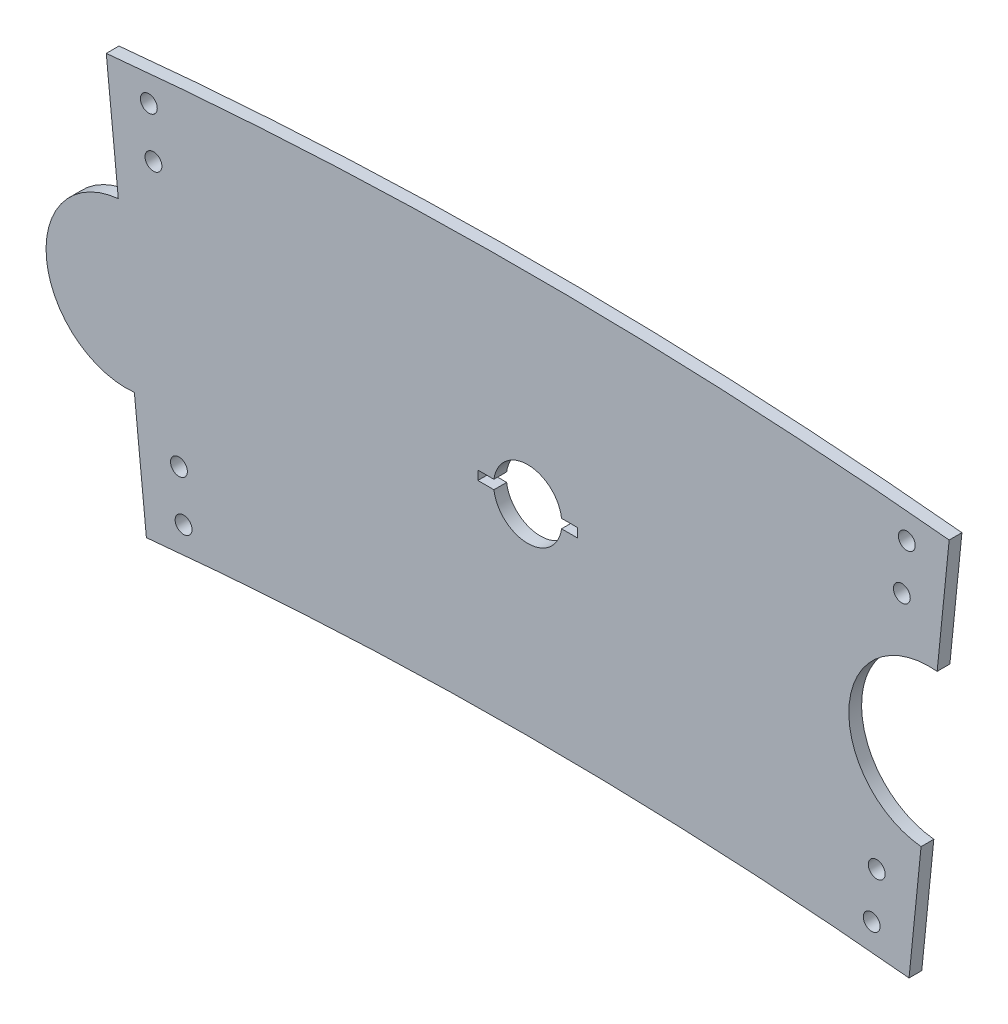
ISO-10303-21;
HEADER;
FILE_DESCRIPTION(('STEP AP214'),'2;1');
FILE_NAME('part.step','',(''),(''),'','','');
FILE_SCHEMA(('AUTOMOTIVE_DESIGN { 1 0 10303 214 1 1 1 1 }'));
ENDSEC;
DATA;
#1=APPLICATION_CONTEXT('core data for automotive mechanical design processes');
#2=APPLICATION_PROTOCOL_DEFINITION('international standard','automotive_design',2000,#1);
#3=PRODUCT_CONTEXT('',#1,'mechanical');
#4=PRODUCT('Part','Part','',(#3));
#5=PRODUCT_RELATED_PRODUCT_CATEGORY('part','',(#4));
#6=PRODUCT_DEFINITION_FORMATION('','',#4);
#7=PRODUCT_DEFINITION_CONTEXT('part definition',#1,'design');
#8=PRODUCT_DEFINITION('design','',#6,#7);
#9=PRODUCT_DEFINITION_SHAPE('','',#8);
#10=(LENGTH_UNIT() NAMED_UNIT(*) SI_UNIT(.MILLI.,.METRE.));
#11=(NAMED_UNIT(*) PLANE_ANGLE_UNIT() SI_UNIT($,.RADIAN.));
#12=(NAMED_UNIT(*) SI_UNIT($,.STERADIAN.) SOLID_ANGLE_UNIT());
#13=UNCERTAINTY_MEASURE_WITH_UNIT(LENGTH_MEASURE(1.E-05),#10,'distance_accuracy_value','');
#14=(GEOMETRIC_REPRESENTATION_CONTEXT(3) GLOBAL_UNCERTAINTY_ASSIGNED_CONTEXT((#13)) GLOBAL_UNIT_ASSIGNED_CONTEXT((#10,
#11,#12)) REPRESENTATION_CONTEXT('',''));
#15=CARTESIAN_POINT('',(0.,0.,0.));
#16=DIRECTION('',(0.,0.,1.));
#17=DIRECTION('',(1.,0.,0.));
#18=AXIS2_PLACEMENT_3D('',#15,#16,#17);
#19=CARTESIAN_POINT('',(1.22464679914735E-13,-1000.,3.175));
#20=DIRECTION('',(0.,0.,1.));
#21=DIRECTION('',(1.,0.,0.));
#22=AXIS2_PLACEMENT_3D('',#19,#20,#21);
#23=PLANE('',#22);
#24=CARTESIAN_POINT('',(-93.2394907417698,27.2898067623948,3.175));
#25=DIRECTION('',(0.,0.,1.));
#26=DIRECTION('',(1.,0.,0.));
#27=AXIS2_PLACEMENT_3D('',#24,#25,#26);
#28=CIRCLE('',#27,2.1);
#29=CARTESIAN_POINT('',(-91.1394907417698,27.2898067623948,3.175));
#30=VERTEX_POINT('',#29);
#31=EDGE_CURVE('E482',#30,#30,#28,.T.);
#32=ORIENTED_EDGE('',*,*,#31,.F.);
#33=EDGE_LOOP('',(#32));
#34=FACE_BOUND('',#33,.T.);
#35=CARTESIAN_POINT('',(-86.8968404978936,-35.3901921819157,3.175));
#36=DIRECTION('',(0.,0.,1.));
#37=DIRECTION('',(1.,0.,0.));
#38=AXIS2_PLACEMENT_3D('',#35,#36,#37);
#39=CIRCLE('',#38,2.1);
#40=CARTESIAN_POINT('',(-84.7968404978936,-35.3901921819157,3.175));
#41=VERTEX_POINT('',#40);
#42=EDGE_CURVE('E484',#41,#41,#39,.T.);
#43=ORIENTED_EDGE('',*,*,#42,.F.);
#44=EDGE_LOOP('',(#43));
#45=FACE_BOUND('',#44,.T.);
#46=CARTESIAN_POINT('',(-85.7394907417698,-47.334251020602,3.175));
#47=DIRECTION('',(0.,0.,1.));
#48=DIRECTION('',(1.,0.,0.));
#49=AXIS2_PLACEMENT_3D('',#46,#47,#48);
#50=CIRCLE('',#49,2.1);
#51=CARTESIAN_POINT('',(-83.6394907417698,-47.334251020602,3.175));
#52=VERTEX_POINT('',#51);
#53=EDGE_CURVE('E438',#52,#52,#50,.T.);
#54=ORIENTED_EDGE('',*,*,#53,.F.);
#55=EDGE_LOOP('',(#54));
#56=FACE_BOUND('',#55,.T.);
#57=CARTESIAN_POINT('',(85.7039755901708,-47.2590481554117,3.175));
#58=DIRECTION('',(0.,0.,1.));
#59=DIRECTION('',(1.,0.,0.));
#60=AXIS2_PLACEMENT_3D('',#57,#58,#59);
#61=CIRCLE('',#60,2.1);
#62=CARTESIAN_POINT('',(87.8039755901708,-47.2590481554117,3.175));
#63=VERTEX_POINT('',#62);
#64=EDGE_CURVE('E472',#63,#63,#61,.T.);
#65=ORIENTED_EDGE('',*,*,#64,.F.);
#66=EDGE_LOOP('',(#65));
#67=FACE_BOUND('',#66,.T.);
#68=CARTESIAN_POINT('',(86.9466105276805,-35.3235607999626,3.175));
#69=DIRECTION('',(0.,0.,1.));
#70=DIRECTION('',(1.,0.,0.));
#71=AXIS2_PLACEMENT_3D('',#68,#69,#70);
#72=CIRCLE('',#71,2.1);
#73=CARTESIAN_POINT('',(89.0466105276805,-35.3235607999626,3.175));
#74=VERTEX_POINT('',#73);
#75=EDGE_CURVE('E470',#74,#74,#72,.T.);
#76=ORIENTED_EDGE('',*,*,#75,.F.);
#77=EDGE_LOOP('',(#76));
#78=FACE_BOUND('',#77,.T.);
#79=CARTESIAN_POINT('',(93.2039755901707,27.3650096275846,3.175));
#80=DIRECTION('',(0.,0.,1.));
#81=DIRECTION('',(1.,0.,0.));
#82=AXIS2_PLACEMENT_3D('',#79,#80,#81);
#83=CIRCLE('',#82,2.1);
#84=CARTESIAN_POINT('',(95.3039755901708,27.3650096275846,3.175));
#85=VERTEX_POINT('',#84);
#86=EDGE_CURVE('E473',#85,#85,#83,.T.);
#87=ORIENTED_EDGE('',*,*,#86,.F.);
#88=EDGE_LOOP('',(#87));
#89=FACE_BOUND('',#88,.T.);
#90=CARTESIAN_POINT('',(94.4466105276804,39.3004969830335,3.175));
#91=DIRECTION('',(0.,0.,1.));
#92=DIRECTION('',(1.,0.,0.));
#93=AXIS2_PLACEMENT_3D('',#90,#91,#92);
#94=CIRCLE('',#93,2.1);
#95=CARTESIAN_POINT('',(96.5466105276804,39.3004969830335,3.175));
#96=VERTEX_POINT('',#95);
#97=EDGE_CURVE('E478',#96,#96,#94,.T.);
#98=ORIENTED_EDGE('',*,*,#97,.F.);
#99=EDGE_LOOP('',(#98));
#100=FACE_BOUND('',#99,.T.);
#101=CARTESIAN_POINT('',(-94.3968404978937,39.2338656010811,3.175));
#102=DIRECTION('',(0.,0.,1.));
#103=DIRECTION('',(1.,0.,0.));
#104=AXIS2_PLACEMENT_3D('',#101,#102,#103);
#105=CIRCLE('',#104,2.1);
#106=CARTESIAN_POINT('',(-92.2968404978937,39.2338656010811,3.175));
#107=VERTEX_POINT('',#106);
#108=EDGE_CURVE('E279',#107,#107,#105,.T.);
#109=ORIENTED_EDGE('',*,*,#108,.F.);
#110=EDGE_LOOP('',(#109));
#111=FACE_BOUND('',#110,.T.);
#112=CARTESIAN_POINT('',(1.22464679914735E-13,-1000.,3.175));
#113=DIRECTION('',(0.,0.,1.));
#114=DIRECTION('',(1.,0.,0.));
#115=AXIS2_PLACEMENT_3D('',#112,#113,#114);
#116=CIRCLE('',#115,1050.);
#117=CARTESIAN_POINT('',(105.,44.7368089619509,3.175));
#118=VERTEX_POINT('',#117);
#119=CARTESIAN_POINT('',(-105.,44.7368089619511,3.175));
#120=VERTEX_POINT('',#119);
#121=EDGE_CURVE('E222',#118,#120,#116,.T.);
#122=ORIENTED_EDGE('',*,*,#121,.T.);
#123=DIRECTION('',(0.0999999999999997,-0.99498743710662,0.));
#124=VECTOR('',#123,1.);
#125=CARTESIAN_POINT('',(-105.,44.7368089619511,3.175));
#126=LINE('',#125,#124);
#127=CARTESIAN_POINT('',(-102.,14.8871858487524,3.175));
#128=VERTEX_POINT('',#127);
#129=EDGE_CURVE('E225',#120,#128,#126,.T.);
#130=ORIENTED_EDGE('',*,*,#129,.T.);
#131=CARTESIAN_POINT('',(-100.,-5.01256289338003,3.175));
#132=DIRECTION('',(0.,0.,1.));
#133=DIRECTION('',(1.,0.,0.));
#134=AXIS2_PLACEMENT_3D('',#131,#132,#133);
#135=CIRCLE('',#134,20.);
#136=CARTESIAN_POINT('',(-98.,-24.9123116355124,3.175));
#137=VERTEX_POINT('',#136);
#138=EDGE_CURVE('E228',#128,#137,#135,.T.);
#139=ORIENTED_EDGE('',*,*,#138,.T.);
#140=DIRECTION('',(0.1,-0.99498743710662,0.));
#141=VECTOR('',#140,1.);
#142=CARTESIAN_POINT('',(-95.,-54.761934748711,3.175));
#143=LINE('',#142,#141);
#144=CARTESIAN_POINT('',(-95.,-54.761934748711,3.175));
#145=VERTEX_POINT('',#144);
#146=EDGE_CURVE('E230',#137,#145,#143,.T.);
#147=ORIENTED_EDGE('',*,*,#146,.T.);
#148=CARTESIAN_POINT('',(1.22464679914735E-13,-1000.,3.175));
#149=DIRECTION('',(0.,0.,-1.));
#150=DIRECTION('',(1.,0.,0.));
#151=AXIS2_PLACEMENT_3D('',#148,#149,#150);
#152=CIRCLE('',#151,950.);
#153=CARTESIAN_POINT('',(95.,-54.761934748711,3.175));
#154=VERTEX_POINT('',#153);
#155=EDGE_CURVE('E232',#145,#154,#152,.T.);
#156=ORIENTED_EDGE('',*,*,#155,.T.);
#157=DIRECTION('',(0.1,0.99498743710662,0.));
#158=VECTOR('',#157,1.);
#159=CARTESIAN_POINT('',(95.,-54.761934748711,3.175));
#160=LINE('',#159,#158);
#161=CARTESIAN_POINT('',(98.,-24.9123116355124,3.175));
#162=VERTEX_POINT('',#161);
#163=EDGE_CURVE('E234',#154,#162,#160,.T.);
#164=ORIENTED_EDGE('',*,*,#163,.T.);
#165=CARTESIAN_POINT('',(100.,-5.01256289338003,3.175));
#166=DIRECTION('',(0.,0.,-1.));
#167=DIRECTION('',(1.,0.,0.));
#168=AXIS2_PLACEMENT_3D('',#165,#166,#167);
#169=CIRCLE('',#168,20.);
#170=CARTESIAN_POINT('',(102.,14.8871858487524,3.175));
#171=VERTEX_POINT('',#170);
#172=EDGE_CURVE('E236',#162,#171,#169,.T.);
#173=ORIENTED_EDGE('',*,*,#172,.T.);
#174=DIRECTION('',(0.0999999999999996,0.99498743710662,0.));
#175=VECTOR('',#174,1.);
#176=CARTESIAN_POINT('',(105.,44.7368089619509,3.175));
#177=LINE('',#176,#175);
#178=EDGE_CURVE('E238',#171,#118,#177,.T.);
#179=ORIENTED_EDGE('',*,*,#178,.T.);
#180=EDGE_LOOP('',(#122,#130,#139,#147,#156,#164,#173,#179));
#181=FACE_BOUND('',#180,.T.);
#182=CARTESIAN_POINT('',(0.,0.,3.175));
#183=DIRECTION('',(0.,0.,1.));
#184=DIRECTION('',(1.,0.,0.));
#185=AXIS2_PLACEMENT_3D('',#182,#183,#184);
#186=CIRCLE('',#185,8.5);
#187=CARTESIAN_POINT('',(8.42522254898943,1.125,3.175));
#188=VERTEX_POINT('',#187);
#189=CARTESIAN_POINT('',(-8.42522254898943,1.125,3.175));
#190=VERTEX_POINT('',#189);
#191=EDGE_CURVE('E164',#188,#190,#186,.T.);
#192=ORIENTED_EDGE('',*,*,#191,.F.);
#193=DIRECTION('',(-1.,0.,0.));
#194=VECTOR('',#193,1.);
#195=CARTESIAN_POINT('',(8.42522254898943,1.125,3.175));
#196=LINE('',#195,#194);
#197=CARTESIAN_POINT('',(12.4252225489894,1.125,3.175));
#198=VERTEX_POINT('',#197);
#199=EDGE_CURVE('E156',#198,#188,#196,.T.);
#200=ORIENTED_EDGE('',*,*,#199,.F.);
#201=DIRECTION('',(0.,1.,0.));
#202=VECTOR('',#201,1.);
#203=CARTESIAN_POINT('',(12.4252225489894,1.125,3.175));
#204=LINE('',#203,#202);
#205=CARTESIAN_POINT('',(12.4252225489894,-1.12499999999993,3.175));
#206=VERTEX_POINT('',#205);
#207=EDGE_CURVE('E190',#206,#198,#204,.T.);
#208=ORIENTED_EDGE('',*,*,#207,.F.);
#209=DIRECTION('',(1.,0.,0.));
#210=VECTOR('',#209,1.);
#211=CARTESIAN_POINT('',(12.4252225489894,-1.125,3.175));
#212=LINE('',#211,#210);
#213=CARTESIAN_POINT('',(8.42522254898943,-1.12500000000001,3.175));
#214=VERTEX_POINT('',#213);
#215=EDGE_CURVE('E188',#214,#206,#212,.T.);
#216=ORIENTED_EDGE('',*,*,#215,.F.);
#217=CARTESIAN_POINT('',(0.,0.,3.175));
#218=DIRECTION('',(0.,0.,1.));
#219=DIRECTION('',(1.,0.,0.));
#220=AXIS2_PLACEMENT_3D('',#217,#218,#219);
#221=CIRCLE('',#220,8.5);
#222=CARTESIAN_POINT('',(-8.42522254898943,-1.125,3.175));
#223=VERTEX_POINT('',#222);
#224=EDGE_CURVE('E186',#223,#214,#221,.T.);
#225=ORIENTED_EDGE('',*,*,#224,.F.);
#226=DIRECTION('',(1.,0.,0.));
#227=VECTOR('',#226,1.);
#228=CARTESIAN_POINT('',(-8.42522254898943,-1.125,3.175));
#229=LINE('',#228,#227);
#230=CARTESIAN_POINT('',(-12.4252225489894,-1.125,3.175));
#231=VERTEX_POINT('',#230);
#232=EDGE_CURVE('E184',#231,#223,#229,.T.);
#233=ORIENTED_EDGE('',*,*,#232,.F.);
#234=DIRECTION('',(0.,-1.,0.));
#235=VECTOR('',#234,1.);
#236=CARTESIAN_POINT('',(-12.4252225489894,-1.125,3.175));
#237=LINE('',#236,#235);
#238=CARTESIAN_POINT('',(-12.4252225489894,1.125,3.175));
#239=VERTEX_POINT('',#238);
#240=EDGE_CURVE('E179',#239,#231,#237,.T.);
#241=ORIENTED_EDGE('',*,*,#240,.F.);
#242=DIRECTION('',(-1.,0.,0.));
#243=VECTOR('',#242,1.);
#244=CARTESIAN_POINT('',(-12.4252225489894,1.125,3.175));
#245=LINE('',#244,#243);
#246=EDGE_CURVE('E177',#190,#239,#245,.T.);
#247=ORIENTED_EDGE('',*,*,#246,.F.);
#248=EDGE_LOOP('',(#192,#200,#208,#216,#225,#233,#241,#247));
#249=FACE_BOUND('',#248,.T.);
#250=ADVANCED_FACE('F41',(#34,#45,#56,#67,#78,#89,#100,#111,#181,#249),#23,.T.);
#251=CARTESIAN_POINT('',(1.22464679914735E-13,-1000.,0.));
#252=DIRECTION('',(0.,0.,1.));
#253=DIRECTION('',(1.,0.,0.));
#254=AXIS2_PLACEMENT_3D('',#251,#252,#253);
#255=PLANE('',#254);
#256=CARTESIAN_POINT('',(-93.2394907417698,27.2898067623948,0.));
#257=DIRECTION('',(0.,0.,1.));
#258=DIRECTION('',(1.,0.,0.));
#259=AXIS2_PLACEMENT_3D('',#256,#257,#258);
#260=CIRCLE('',#259,2.1);
#261=CARTESIAN_POINT('',(-91.1394907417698,27.2898067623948,0.));
#262=VERTEX_POINT('',#261);
#263=EDGE_CURVE('E45',#262,#262,#260,.T.);
#264=ORIENTED_EDGE('',*,*,#263,.T.);
#265=EDGE_LOOP('',(#264));
#266=FACE_BOUND('',#265,.T.);
#267=CARTESIAN_POINT('',(-86.8968404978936,-35.3901921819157,0.));
#268=DIRECTION('',(0.,0.,1.));
#269=DIRECTION('',(1.,0.,0.));
#270=AXIS2_PLACEMENT_3D('',#267,#268,#269);
#271=CIRCLE('',#270,2.1);
#272=CARTESIAN_POINT('',(-84.7968404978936,-35.3901921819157,0.));
#273=VERTEX_POINT('',#272);
#274=EDGE_CURVE('E293',#273,#273,#271,.T.);
#275=ORIENTED_EDGE('',*,*,#274,.T.);
#276=EDGE_LOOP('',(#275));
#277=FACE_BOUND('',#276,.T.);
#278=CARTESIAN_POINT('',(-85.7394907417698,-47.334251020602,0.));
#279=DIRECTION('',(0.,0.,1.));
#280=DIRECTION('',(1.,0.,0.));
#281=AXIS2_PLACEMENT_3D('',#278,#279,#280);
#282=CIRCLE('',#281,2.1);
#283=CARTESIAN_POINT('',(-83.6394907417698,-47.334251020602,0.));
#284=VERTEX_POINT('',#283);
#285=EDGE_CURVE('E291',#284,#284,#282,.T.);
#286=ORIENTED_EDGE('',*,*,#285,.T.);
#287=EDGE_LOOP('',(#286));
#288=FACE_BOUND('',#287,.T.);
#289=CARTESIAN_POINT('',(85.7039755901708,-47.2590481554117,0.));
#290=DIRECTION('',(0.,0.,1.));
#291=DIRECTION('',(1.,0.,0.));
#292=AXIS2_PLACEMENT_3D('',#289,#290,#291);
#293=CIRCLE('',#292,2.1);
#294=CARTESIAN_POINT('',(87.8039755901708,-47.2590481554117,0.));
#295=VERTEX_POINT('',#294);
#296=EDGE_CURVE('E288',#295,#295,#293,.T.);
#297=ORIENTED_EDGE('',*,*,#296,.T.);
#298=EDGE_LOOP('',(#297));
#299=FACE_BOUND('',#298,.T.);
#300=CARTESIAN_POINT('',(86.9466105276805,-35.3235607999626,0.));
#301=DIRECTION('',(0.,0.,1.));
#302=DIRECTION('',(1.,0.,0.));
#303=AXIS2_PLACEMENT_3D('',#300,#301,#302);
#304=CIRCLE('',#303,2.1);
#305=CARTESIAN_POINT('',(89.0466105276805,-35.3235607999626,0.));
#306=VERTEX_POINT('',#305);
#307=EDGE_CURVE('E285',#306,#306,#304,.T.);
#308=ORIENTED_EDGE('',*,*,#307,.T.);
#309=EDGE_LOOP('',(#308));
#310=FACE_BOUND('',#309,.T.);
#311=CARTESIAN_POINT('',(93.2039755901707,27.3650096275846,0.));
#312=DIRECTION('',(0.,0.,1.));
#313=DIRECTION('',(1.,0.,0.));
#314=AXIS2_PLACEMENT_3D('',#311,#312,#313);
#315=CIRCLE('',#314,2.1);
#316=CARTESIAN_POINT('',(95.3039755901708,27.3650096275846,0.));
#317=VERTEX_POINT('',#316);
#318=EDGE_CURVE('E282',#317,#317,#315,.T.);
#319=ORIENTED_EDGE('',*,*,#318,.T.);
#320=EDGE_LOOP('',(#319));
#321=FACE_BOUND('',#320,.T.);
#322=CARTESIAN_POINT('',(94.4466105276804,39.3004969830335,0.));
#323=DIRECTION('',(0.,0.,1.));
#324=DIRECTION('',(1.,0.,0.));
#325=AXIS2_PLACEMENT_3D('',#322,#323,#324);
#326=CIRCLE('',#325,2.1);
#327=CARTESIAN_POINT('',(96.5466105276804,39.3004969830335,0.));
#328=VERTEX_POINT('',#327);
#329=EDGE_CURVE('E278',#328,#328,#326,.T.);
#330=ORIENTED_EDGE('',*,*,#329,.T.);
#331=EDGE_LOOP('',(#330));
#332=FACE_BOUND('',#331,.T.);
#333=CARTESIAN_POINT('',(-94.3968404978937,39.2338656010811,0.));
#334=DIRECTION('',(0.,0.,1.));
#335=DIRECTION('',(1.,0.,0.));
#336=AXIS2_PLACEMENT_3D('',#333,#334,#335);
#337=CIRCLE('',#336,2.1);
#338=CARTESIAN_POINT('',(-92.2968404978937,39.2338656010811,0.));
#339=VERTEX_POINT('',#338);
#340=EDGE_CURVE('E275',#339,#339,#337,.T.);
#341=ORIENTED_EDGE('',*,*,#340,.T.);
#342=EDGE_LOOP('',(#341));
#343=FACE_BOUND('',#342,.T.);
#344=CARTESIAN_POINT('',(1.22464679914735E-13,-1000.,0.));
#345=DIRECTION('',(0.,0.,1.));
#346=DIRECTION('',(1.,0.,0.));
#347=AXIS2_PLACEMENT_3D('',#344,#345,#346);
#348=CIRCLE('',#347,1050.);
#349=CARTESIAN_POINT('',(105.,44.7368089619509,0.));
#350=VERTEX_POINT('',#349);
#351=CARTESIAN_POINT('',(-105.,44.7368089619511,0.));
#352=VERTEX_POINT('',#351);
#353=EDGE_CURVE('E172',#350,#352,#348,.T.);
#354=ORIENTED_EDGE('',*,*,#353,.F.);
#355=DIRECTION('',(0.0999999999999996,0.99498743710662,0.));
#356=VECTOR('',#355,1.);
#357=CARTESIAN_POINT('',(105.,44.7368089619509,0.));
#358=LINE('',#357,#356);
#359=CARTESIAN_POINT('',(102.,14.8871858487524,0.));
#360=VERTEX_POINT('',#359);
#361=EDGE_CURVE('E226',#360,#350,#358,.T.);
#362=ORIENTED_EDGE('',*,*,#361,.F.);
#363=CARTESIAN_POINT('',(100.,-5.01256289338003,0.));
#364=DIRECTION('',(0.,0.,-1.));
#365=DIRECTION('',(1.,0.,0.));
#366=AXIS2_PLACEMENT_3D('',#363,#364,#365);
#367=CIRCLE('',#366,20.);
#368=CARTESIAN_POINT('',(98.,-24.9123116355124,0.));
#369=VERTEX_POINT('',#368);
#370=EDGE_CURVE('E253',#369,#360,#367,.T.);
#371=ORIENTED_EDGE('',*,*,#370,.F.);
#372=DIRECTION('',(0.1,0.99498743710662,0.));
#373=VECTOR('',#372,1.);
#374=CARTESIAN_POINT('',(95.,-54.761934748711,0.));
#375=LINE('',#374,#373);
#376=CARTESIAN_POINT('',(95.,-54.761934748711,0.));
#377=VERTEX_POINT('',#376);
#378=EDGE_CURVE('E251',#377,#369,#375,.T.);
#379=ORIENTED_EDGE('',*,*,#378,.F.);
#380=CARTESIAN_POINT('',(1.22464679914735E-13,-1000.,0.));
#381=DIRECTION('',(0.,0.,-1.));
#382=DIRECTION('',(1.,0.,0.));
#383=AXIS2_PLACEMENT_3D('',#380,#381,#382);
#384=CIRCLE('',#383,950.);
#385=CARTESIAN_POINT('',(-95.,-54.761934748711,0.));
#386=VERTEX_POINT('',#385);
#387=EDGE_CURVE('E249',#386,#377,#384,.T.);
#388=ORIENTED_EDGE('',*,*,#387,.F.);
#389=DIRECTION('',(0.1,-0.99498743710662,0.));
#390=VECTOR('',#389,1.);
#391=CARTESIAN_POINT('',(-95.,-54.761934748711,0.));
#392=LINE('',#391,#390);
#393=CARTESIAN_POINT('',(-98.,-24.9123116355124,0.));
#394=VERTEX_POINT('',#393);
#395=EDGE_CURVE('E247',#394,#386,#392,.T.);
#396=ORIENTED_EDGE('',*,*,#395,.F.);
#397=CARTESIAN_POINT('',(-100.,-5.01256289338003,0.));
#398=DIRECTION('',(0.,0.,1.));
#399=DIRECTION('',(1.,0.,0.));
#400=AXIS2_PLACEMENT_3D('',#397,#398,#399);
#401=CIRCLE('',#400,20.);
#402=CARTESIAN_POINT('',(-102.,14.8871858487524,0.));
#403=VERTEX_POINT('',#402);
#404=EDGE_CURVE('E245',#403,#394,#401,.T.);
#405=ORIENTED_EDGE('',*,*,#404,.F.);
#406=DIRECTION('',(0.0999999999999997,-0.99498743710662,0.));
#407=VECTOR('',#406,1.);
#408=CARTESIAN_POINT('',(-105.,44.7368089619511,0.));
#409=LINE('',#408,#407);
#410=EDGE_CURVE('E243',#352,#403,#409,.T.);
#411=ORIENTED_EDGE('',*,*,#410,.F.);
#412=EDGE_LOOP('',(#354,#362,#371,#379,#388,#396,#405,#411));
#413=FACE_BOUND('',#412,.T.);
#414=DIRECTION('',(-1.,0.,0.));
#415=VECTOR('',#414,1.);
#416=CARTESIAN_POINT('',(8.42522254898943,1.125,0.));
#417=LINE('',#416,#415);
#418=CARTESIAN_POINT('',(12.4252225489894,1.12500000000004,0.));
#419=VERTEX_POINT('',#418);
#420=CARTESIAN_POINT('',(8.42522254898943,1.125,0.));
#421=VERTEX_POINT('',#420);
#422=EDGE_CURVE('E66',#419,#421,#417,.T.);
#423=ORIENTED_EDGE('',*,*,#422,.T.);
#424=CARTESIAN_POINT('',(0.,0.,0.));
#425=DIRECTION('',(0.,0.,1.));
#426=DIRECTION('',(1.,0.,0.));
#427=AXIS2_PLACEMENT_3D('',#424,#425,#426);
#428=CIRCLE('',#427,8.5);
#429=CARTESIAN_POINT('',(-8.42522254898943,1.125,0.));
#430=VERTEX_POINT('',#429);
#431=EDGE_CURVE('E171',#421,#430,#428,.T.);
#432=ORIENTED_EDGE('',*,*,#431,.T.);
#433=DIRECTION('',(-1.,0.,0.));
#434=VECTOR('',#433,1.);
#435=CARTESIAN_POINT('',(-12.4252225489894,1.125,0.));
#436=LINE('',#435,#434);
#437=CARTESIAN_POINT('',(-12.4252225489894,1.125,0.));
#438=VERTEX_POINT('',#437);
#439=EDGE_CURVE('E194',#430,#438,#436,.T.);
#440=ORIENTED_EDGE('',*,*,#439,.T.);
#441=DIRECTION('',(0.,-1.,0.));
#442=VECTOR('',#441,1.);
#443=CARTESIAN_POINT('',(-12.4252225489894,-1.125,0.));
#444=LINE('',#443,#442);
#445=CARTESIAN_POINT('',(-12.4252225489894,-1.125,0.));
#446=VERTEX_POINT('',#445);
#447=EDGE_CURVE('E197',#438,#446,#444,.T.);
#448=ORIENTED_EDGE('',*,*,#447,.T.);
#449=DIRECTION('',(1.,0.,0.));
#450=VECTOR('',#449,1.);
#451=CARTESIAN_POINT('',(-8.42522254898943,-1.125,0.));
#452=LINE('',#451,#450);
#453=CARTESIAN_POINT('',(-8.42522254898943,-1.125,0.));
#454=VERTEX_POINT('',#453);
#455=EDGE_CURVE('E200',#446,#454,#452,.T.);
#456=ORIENTED_EDGE('',*,*,#455,.T.);
#457=CARTESIAN_POINT('',(0.,0.,0.));
#458=DIRECTION('',(0.,0.,1.));
#459=DIRECTION('',(1.,0.,0.));
#460=AXIS2_PLACEMENT_3D('',#457,#458,#459);
#461=CIRCLE('',#460,8.5);
#462=CARTESIAN_POINT('',(8.42522254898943,-1.12500000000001,0.));
#463=VERTEX_POINT('',#462);
#464=EDGE_CURVE('E203',#454,#463,#461,.T.);
#465=ORIENTED_EDGE('',*,*,#464,.T.);
#466=DIRECTION('',(1.,0.,0.));
#467=VECTOR('',#466,1.);
#468=CARTESIAN_POINT('',(12.4252225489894,-1.125,0.));
#469=LINE('',#468,#467);
#470=CARTESIAN_POINT('',(12.4252225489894,-1.125,0.));
#471=VERTEX_POINT('',#470);
#472=EDGE_CURVE('E206',#463,#471,#469,.T.);
#473=ORIENTED_EDGE('',*,*,#472,.T.);
#474=DIRECTION('',(0.,1.,0.));
#475=VECTOR('',#474,1.);
#476=CARTESIAN_POINT('',(12.4252225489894,1.125,0.));
#477=LINE('',#476,#475);
#478=EDGE_CURVE('E165',#471,#419,#477,.T.);
#479=ORIENTED_EDGE('',*,*,#478,.T.);
#480=EDGE_LOOP('',(#423,#432,#440,#448,#456,#465,#473,#479));
#481=FACE_BOUND('',#480,.T.);
#482=ADVANCED_FACE('F300',(#266,#277,#288,#299,#310,#321,#332,#343,#413,#481),#255,.F.);
#483=CARTESIAN_POINT('',(1.22464679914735E-13,-1000.,3.175));
#484=DIRECTION('',(0.,0.,-1.));
#485=DIRECTION('',(-1.,0.,0.));
#486=AXIS2_PLACEMENT_3D('',#483,#484,#485);
#487=CYLINDRICAL_SURFACE('',#486,1050.);
#488=ORIENTED_EDGE('',*,*,#353,.T.);
#489=DIRECTION('',(0.,0.,-1.));
#490=VECTOR('',#489,1.);
#491=CARTESIAN_POINT('',(-105.,44.7368089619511,3.175));
#492=LINE('',#491,#490);
#493=EDGE_CURVE('E11',#120,#352,#492,.T.);
#494=ORIENTED_EDGE('',*,*,#493,.F.);
#495=ORIENTED_EDGE('',*,*,#121,.F.);
#496=DIRECTION('',(0.,0.,-1.));
#497=VECTOR('',#496,1.);
#498=CARTESIAN_POINT('',(105.,44.7368089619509,3.175));
#499=LINE('',#498,#497);
#500=EDGE_CURVE('E240',#118,#350,#499,.T.);
#501=ORIENTED_EDGE('',*,*,#500,.T.);
#502=EDGE_LOOP('',(#488,#494,#495,#501));
#503=FACE_BOUND('',#502,.T.);
#504=ADVANCED_FACE('F43',(#503),#487,.T.);
#505=CARTESIAN_POINT('',(-105.,44.7368089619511,3.175));
#506=DIRECTION('',(0.99498743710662,0.0999999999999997,0.));
#507=DIRECTION('',(-0.0999999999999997,0.99498743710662,0.));
#508=AXIS2_PLACEMENT_3D('',#505,#506,#507);
#509=PLANE('',#508);
#510=ORIENTED_EDGE('',*,*,#410,.T.);
#511=DIRECTION('',(0.,0.,-1.));
#512=VECTOR('',#511,1.);
#513=CARTESIAN_POINT('',(-102.,14.8871858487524,3.175));
#514=LINE('',#513,#512);
#515=EDGE_CURVE('E50',#128,#403,#514,.T.);
#516=ORIENTED_EDGE('',*,*,#515,.F.);
#517=ORIENTED_EDGE('',*,*,#129,.F.);
#518=ORIENTED_EDGE('',*,*,#493,.T.);
#519=EDGE_LOOP('',(#510,#516,#517,#518));
#520=FACE_BOUND('',#519,.T.);
#521=ADVANCED_FACE('F350',(#520),#509,.F.);
#522=CARTESIAN_POINT('',(-100.,-5.01256289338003,3.175));
#523=DIRECTION('',(0.,0.,-1.));
#524=DIRECTION('',(-1.,0.,0.));
#525=AXIS2_PLACEMENT_3D('',#522,#523,#524);
#526=CYLINDRICAL_SURFACE('',#525,20.);
#527=ORIENTED_EDGE('',*,*,#404,.T.);
#528=DIRECTION('',(0.,0.,-1.));
#529=VECTOR('',#528,1.);
#530=CARTESIAN_POINT('',(-98.,-24.9123116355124,3.175));
#531=LINE('',#530,#529);
#532=EDGE_CURVE('E270',#137,#394,#531,.T.);
#533=ORIENTED_EDGE('',*,*,#532,.F.);
#534=ORIENTED_EDGE('',*,*,#138,.F.);
#535=ORIENTED_EDGE('',*,*,#515,.T.);
#536=EDGE_LOOP('',(#527,#533,#534,#535));
#537=FACE_BOUND('',#536,.T.);
#538=ADVANCED_FACE('F347',(#537),#526,.T.);
#539=CARTESIAN_POINT('',(-95.,-54.761934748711,3.175));
#540=DIRECTION('',(0.99498743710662,0.1,0.));
#541=DIRECTION('',(-0.1,0.99498743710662,0.));
#542=AXIS2_PLACEMENT_3D('',#539,#540,#541);
#543=PLANE('',#542);
#544=ORIENTED_EDGE('',*,*,#395,.T.);
#545=DIRECTION('',(0.,0.,-1.));
#546=VECTOR('',#545,1.);
#547=CARTESIAN_POINT('',(-95.,-54.761934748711,3.175));
#548=LINE('',#547,#546);
#549=EDGE_CURVE('E267',#145,#386,#548,.T.);
#550=ORIENTED_EDGE('',*,*,#549,.F.);
#551=ORIENTED_EDGE('',*,*,#146,.F.);
#552=ORIENTED_EDGE('',*,*,#532,.T.);
#553=EDGE_LOOP('',(#544,#550,#551,#552));
#554=FACE_BOUND('',#553,.T.);
#555=ADVANCED_FACE('F343',(#554),#543,.F.);
#556=CARTESIAN_POINT('',(1.22464679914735E-13,-1000.,3.175));
#557=DIRECTION('',(0.,0.,-1.));
#558=DIRECTION('',(-1.,0.,0.));
#559=AXIS2_PLACEMENT_3D('',#556,#557,#558);
#560=CYLINDRICAL_SURFACE('',#559,950.);
#561=ORIENTED_EDGE('',*,*,#387,.T.);
#562=DIRECTION('',(0.,0.,-1.));
#563=VECTOR('',#562,1.);
#564=CARTESIAN_POINT('',(95.,-54.761934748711,3.175));
#565=LINE('',#564,#563);
#566=EDGE_CURVE('E264',#154,#377,#565,.T.);
#567=ORIENTED_EDGE('',*,*,#566,.F.);
#568=ORIENTED_EDGE('',*,*,#155,.F.);
#569=ORIENTED_EDGE('',*,*,#549,.T.);
#570=EDGE_LOOP('',(#561,#567,#568,#569));
#571=FACE_BOUND('',#570,.T.);
#572=ADVANCED_FACE('F339',(#571),#560,.F.);
#573=CARTESIAN_POINT('',(95.,-54.761934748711,3.175));
#574=DIRECTION('',(-0.99498743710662,0.1,0.));
#575=DIRECTION('',(-0.1,-0.99498743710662,0.));
#576=AXIS2_PLACEMENT_3D('',#573,#574,#575);
#577=PLANE('',#576);
#578=ORIENTED_EDGE('',*,*,#378,.T.);
#579=DIRECTION('',(0.,0.,-1.));
#580=VECTOR('',#579,1.);
#581=CARTESIAN_POINT('',(98.,-24.9123116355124,3.175));
#582=LINE('',#581,#580);
#583=EDGE_CURVE('E261',#162,#369,#582,.T.);
#584=ORIENTED_EDGE('',*,*,#583,.F.);
#585=ORIENTED_EDGE('',*,*,#163,.F.);
#586=ORIENTED_EDGE('',*,*,#566,.T.);
#587=EDGE_LOOP('',(#578,#584,#585,#586));
#588=FACE_BOUND('',#587,.T.);
#589=ADVANCED_FACE('F335',(#588),#577,.F.);
#590=CARTESIAN_POINT('',(100.,-5.01256289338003,3.175));
#591=DIRECTION('',(0.,0.,-1.));
#592=DIRECTION('',(-1.,0.,0.));
#593=AXIS2_PLACEMENT_3D('',#590,#591,#592);
#594=CYLINDRICAL_SURFACE('',#593,20.);
#595=ORIENTED_EDGE('',*,*,#370,.T.);
#596=DIRECTION('',(0.,0.,-1.));
#597=VECTOR('',#596,1.);
#598=CARTESIAN_POINT('',(102.,14.8871858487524,3.175));
#599=LINE('',#598,#597);
#600=EDGE_CURVE('E258',#171,#360,#599,.T.);
#601=ORIENTED_EDGE('',*,*,#600,.F.);
#602=ORIENTED_EDGE('',*,*,#172,.F.);
#603=ORIENTED_EDGE('',*,*,#583,.T.);
#604=EDGE_LOOP('',(#595,#601,#602,#603));
#605=FACE_BOUND('',#604,.T.);
#606=ADVANCED_FACE('F331',(#605),#594,.F.);
#607=CARTESIAN_POINT('',(105.,44.7368089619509,3.175));
#608=DIRECTION('',(-0.99498743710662,0.0999999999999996,0.));
#609=DIRECTION('',(-0.0999999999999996,-0.99498743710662,0.));
#610=AXIS2_PLACEMENT_3D('',#607,#608,#609);
#611=PLANE('',#610);
#612=ORIENTED_EDGE('',*,*,#361,.T.);
#613=ORIENTED_EDGE('',*,*,#500,.F.);
#614=ORIENTED_EDGE('',*,*,#178,.F.);
#615=ORIENTED_EDGE('',*,*,#600,.T.);
#616=EDGE_LOOP('',(#612,#613,#614,#615));
#617=FACE_BOUND('',#616,.T.);
#618=ADVANCED_FACE('F328',(#617),#611,.F.);
#619=CARTESIAN_POINT('',(8.42522254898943,1.125,3.175));
#620=DIRECTION('',(0.,-1.,0.));
#621=DIRECTION('',(1.,0.,0.));
#622=AXIS2_PLACEMENT_3D('',#619,#620,#621);
#623=PLANE('',#622);
#624=ORIENTED_EDGE('',*,*,#422,.F.);
#625=DIRECTION('',(0.,0.,-1.));
#626=VECTOR('',#625,1.);
#627=CARTESIAN_POINT('',(12.4252225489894,1.125,3.175));
#628=LINE('',#627,#626);
#629=EDGE_CURVE('E160',#198,#419,#628,.T.);
#630=ORIENTED_EDGE('',*,*,#629,.F.);
#631=ORIENTED_EDGE('',*,*,#199,.T.);
#632=DIRECTION('',(0.,0.,-1.));
#633=VECTOR('',#632,1.);
#634=CARTESIAN_POINT('',(8.42522254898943,1.125,3.175));
#635=LINE('',#634,#633);
#636=EDGE_CURVE('E159',#188,#421,#635,.T.);
#637=ORIENTED_EDGE('',*,*,#636,.T.);
#638=EDGE_LOOP('',(#624,#630,#631,#637));
#639=FACE_BOUND('',#638,.T.);
#640=ADVANCED_FACE('F158',(#639),#623,.T.);
#641=CARTESIAN_POINT('',(0.,0.,3.175));
#642=DIRECTION('',(0.,0.,-1.));
#643=DIRECTION('',(-1.,0.,0.));
#644=AXIS2_PLACEMENT_3D('',#641,#642,#643);
#645=CYLINDRICAL_SURFACE('',#644,8.5);
#646=ORIENTED_EDGE('',*,*,#431,.F.);
#647=ORIENTED_EDGE('',*,*,#636,.F.);
#648=ORIENTED_EDGE('',*,*,#191,.T.);
#649=DIRECTION('',(0.,0.,-1.));
#650=VECTOR('',#649,1.);
#651=CARTESIAN_POINT('',(-8.42522254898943,1.125,3.175));
#652=LINE('',#651,#650);
#653=EDGE_CURVE('E173',#190,#430,#652,.T.);
#654=ORIENTED_EDGE('',*,*,#653,.T.);
#655=EDGE_LOOP('',(#646,#647,#648,#654));
#656=FACE_BOUND('',#655,.T.);
#657=ADVANCED_FACE('F168',(#656),#645,.F.);
#658=CARTESIAN_POINT('',(-12.4252225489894,1.125,3.175));
#659=DIRECTION('',(0.,-1.,0.));
#660=DIRECTION('',(1.,0.,0.));
#661=AXIS2_PLACEMENT_3D('',#658,#659,#660);
#662=PLANE('',#661);
#663=ORIENTED_EDGE('',*,*,#439,.F.);
#664=ORIENTED_EDGE('',*,*,#653,.F.);
#665=ORIENTED_EDGE('',*,*,#246,.T.);
#666=DIRECTION('',(0.,0.,-1.));
#667=VECTOR('',#666,1.);
#668=CARTESIAN_POINT('',(-12.4252225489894,1.125,3.175));
#669=LINE('',#668,#667);
#670=EDGE_CURVE('E219',#239,#438,#669,.T.);
#671=ORIENTED_EDGE('',*,*,#670,.T.);
#672=EDGE_LOOP('',(#663,#664,#665,#671));
#673=FACE_BOUND('',#672,.T.);
#674=ADVANCED_FACE('F405',(#673),#662,.T.);
#675=CARTESIAN_POINT('',(-12.4252225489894,-1.125,3.175));
#676=DIRECTION('',(1.,0.,0.));
#677=DIRECTION('',(0.,0.,-1.));
#678=AXIS2_PLACEMENT_3D('',#675,#676,#677);
#679=PLANE('',#678);
#680=ORIENTED_EDGE('',*,*,#447,.F.);
#681=ORIENTED_EDGE('',*,*,#670,.F.);
#682=ORIENTED_EDGE('',*,*,#240,.T.);
#683=DIRECTION('',(0.,0.,-1.));
#684=VECTOR('',#683,1.);
#685=CARTESIAN_POINT('',(-12.4252225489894,-1.125,3.175));
#686=LINE('',#685,#684);
#687=EDGE_CURVE('E217',#231,#446,#686,.T.);
#688=ORIENTED_EDGE('',*,*,#687,.T.);
#689=EDGE_LOOP('',(#680,#681,#682,#688));
#690=FACE_BOUND('',#689,.T.);
#691=ADVANCED_FACE('F402',(#690),#679,.T.);
#692=CARTESIAN_POINT('',(-8.42522254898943,-1.125,3.175));
#693=DIRECTION('',(0.,1.,0.));
#694=DIRECTION('',(-1.,0.,0.));
#695=AXIS2_PLACEMENT_3D('',#692,#693,#694);
#696=PLANE('',#695);
#697=ORIENTED_EDGE('',*,*,#455,.F.);
#698=ORIENTED_EDGE('',*,*,#687,.F.);
#699=ORIENTED_EDGE('',*,*,#232,.T.);
#700=DIRECTION('',(0.,0.,-1.));
#701=VECTOR('',#700,1.);
#702=CARTESIAN_POINT('',(-8.42522254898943,-1.125,3.175));
#703=LINE('',#702,#701);
#704=EDGE_CURVE('E215',#223,#454,#703,.T.);
#705=ORIENTED_EDGE('',*,*,#704,.T.);
#706=EDGE_LOOP('',(#697,#698,#699,#705));
#707=FACE_BOUND('',#706,.T.);
#708=ADVANCED_FACE('F397',(#707),#696,.T.);
#709=CARTESIAN_POINT('',(0.,0.,3.175));
#710=DIRECTION('',(0.,0.,-1.));
#711=DIRECTION('',(-1.,0.,0.));
#712=AXIS2_PLACEMENT_3D('',#709,#710,#711);
#713=CYLINDRICAL_SURFACE('',#712,8.5);
#714=ORIENTED_EDGE('',*,*,#464,.F.);
#715=ORIENTED_EDGE('',*,*,#704,.F.);
#716=ORIENTED_EDGE('',*,*,#224,.T.);
#717=DIRECTION('',(0.,0.,-1.));
#718=VECTOR('',#717,1.);
#719=CARTESIAN_POINT('',(8.42522254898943,-1.12500000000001,3.175));
#720=LINE('',#719,#718);
#721=EDGE_CURVE('E213',#214,#463,#720,.T.);
#722=ORIENTED_EDGE('',*,*,#721,.T.);
#723=EDGE_LOOP('',(#714,#715,#716,#722));
#724=FACE_BOUND('',#723,.T.);
#725=ADVANCED_FACE('F393',(#724),#713,.F.);
#726=CARTESIAN_POINT('',(12.4252225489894,-1.125,3.175));
#727=DIRECTION('',(0.,1.,0.));
#728=DIRECTION('',(-1.,0.,0.));
#729=AXIS2_PLACEMENT_3D('',#726,#727,#728);
#730=PLANE('',#729);
#731=ORIENTED_EDGE('',*,*,#472,.F.);
#732=ORIENTED_EDGE('',*,*,#721,.F.);
#733=ORIENTED_EDGE('',*,*,#215,.T.);
#734=DIRECTION('',(0.,0.,-1.));
#735=VECTOR('',#734,1.);
#736=CARTESIAN_POINT('',(12.4252225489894,-1.125,3.175));
#737=LINE('',#736,#735);
#738=EDGE_CURVE('E58',#206,#471,#737,.T.);
#739=ORIENTED_EDGE('',*,*,#738,.T.);
#740=EDGE_LOOP('',(#731,#732,#733,#739));
#741=FACE_BOUND('',#740,.T.);
#742=ADVANCED_FACE('F390',(#741),#730,.T.);
#743=CARTESIAN_POINT('',(12.4252225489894,1.125,3.175));
#744=DIRECTION('',(-1.,0.,0.));
#745=DIRECTION('',(0.,0.,1.));
#746=AXIS2_PLACEMENT_3D('',#743,#744,#745);
#747=PLANE('',#746);
#748=ORIENTED_EDGE('',*,*,#478,.F.);
#749=ORIENTED_EDGE('',*,*,#738,.F.);
#750=ORIENTED_EDGE('',*,*,#207,.T.);
#751=ORIENTED_EDGE('',*,*,#629,.T.);
#752=EDGE_LOOP('',(#748,#749,#750,#751));
#753=FACE_BOUND('',#752,.T.);
#754=ADVANCED_FACE('F384',(#753),#747,.T.);
#755=CARTESIAN_POINT('',(-94.3968404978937,39.2338656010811,-6.825));
#756=DIRECTION('',(0.,0.,1.));
#757=DIRECTION('',(1.,0.,0.));
#758=AXIS2_PLACEMENT_3D('',#755,#756,#757);
#759=CYLINDRICAL_SURFACE('',#758,2.1);
#760=ORIENTED_EDGE('',*,*,#108,.T.);
#761=EDGE_LOOP('',(#760));
#762=FACE_BOUND('',#761,.T.);
#763=ORIENTED_EDGE('',*,*,#340,.F.);
#764=EDGE_LOOP('',(#763));
#765=FACE_BOUND('',#764,.T.);
#766=ADVANCED_FACE('F421',(#762,#765),#759,.F.);
#767=CARTESIAN_POINT('',(94.4466105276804,39.3004969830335,-6.825));
#768=DIRECTION('',(0.,0.,1.));
#769=DIRECTION('',(1.,0.,0.));
#770=AXIS2_PLACEMENT_3D('',#767,#768,#769);
#771=CYLINDRICAL_SURFACE('',#770,2.1);
#772=ORIENTED_EDGE('',*,*,#97,.T.);
#773=EDGE_LOOP('',(#772));
#774=FACE_BOUND('',#773,.T.);
#775=ORIENTED_EDGE('',*,*,#329,.F.);
#776=EDGE_LOOP('',(#775));
#777=FACE_BOUND('',#776,.T.);
#778=ADVANCED_FACE('F424',(#774,#777),#771,.F.);
#779=CARTESIAN_POINT('',(93.2039755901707,27.3650096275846,-6.825));
#780=DIRECTION('',(0.,0.,1.));
#781=DIRECTION('',(1.,0.,0.));
#782=AXIS2_PLACEMENT_3D('',#779,#780,#781);
#783=CYLINDRICAL_SURFACE('',#782,2.1);
#784=ORIENTED_EDGE('',*,*,#86,.T.);
#785=EDGE_LOOP('',(#784));
#786=FACE_BOUND('',#785,.T.);
#787=ORIENTED_EDGE('',*,*,#318,.F.);
#788=EDGE_LOOP('',(#787));
#789=FACE_BOUND('',#788,.T.);
#790=ADVANCED_FACE('F454',(#786,#789),#783,.F.);
#791=CARTESIAN_POINT('',(86.9466105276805,-35.3235607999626,-6.825));
#792=DIRECTION('',(0.,0.,1.));
#793=DIRECTION('',(1.,0.,0.));
#794=AXIS2_PLACEMENT_3D('',#791,#792,#793);
#795=CYLINDRICAL_SURFACE('',#794,2.1);
#796=ORIENTED_EDGE('',*,*,#75,.T.);
#797=EDGE_LOOP('',(#796));
#798=FACE_BOUND('',#797,.T.);
#799=ORIENTED_EDGE('',*,*,#307,.F.);
#800=EDGE_LOOP('',(#799));
#801=FACE_BOUND('',#800,.T.);
#802=ADVANCED_FACE('F429',(#798,#801),#795,.F.);
#803=CARTESIAN_POINT('',(85.7039755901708,-47.2590481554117,-6.825));
#804=DIRECTION('',(0.,0.,1.));
#805=DIRECTION('',(1.,0.,0.));
#806=AXIS2_PLACEMENT_3D('',#803,#804,#805);
#807=CYLINDRICAL_SURFACE('',#806,2.1);
#808=ORIENTED_EDGE('',*,*,#64,.T.);
#809=EDGE_LOOP('',(#808));
#810=FACE_BOUND('',#809,.T.);
#811=ORIENTED_EDGE('',*,*,#296,.F.);
#812=EDGE_LOOP('',(#811));
#813=FACE_BOUND('',#812,.T.);
#814=ADVANCED_FACE('F426',(#810,#813),#807,.F.);
#815=CARTESIAN_POINT('',(-85.7394907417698,-47.334251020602,-6.825));
#816=DIRECTION('',(0.,0.,1.));
#817=DIRECTION('',(1.,0.,0.));
#818=AXIS2_PLACEMENT_3D('',#815,#816,#817);
#819=CYLINDRICAL_SURFACE('',#818,2.1);
#820=ORIENTED_EDGE('',*,*,#53,.T.);
#821=EDGE_LOOP('',(#820));
#822=FACE_BOUND('',#821,.T.);
#823=ORIENTED_EDGE('',*,*,#285,.F.);
#824=EDGE_LOOP('',(#823));
#825=FACE_BOUND('',#824,.T.);
#826=ADVANCED_FACE('F310',(#822,#825),#819,.F.);
#827=CARTESIAN_POINT('',(-86.8968404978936,-35.3901921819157,-6.825));
#828=DIRECTION('',(0.,0.,1.));
#829=DIRECTION('',(1.,0.,0.));
#830=AXIS2_PLACEMENT_3D('',#827,#828,#829);
#831=CYLINDRICAL_SURFACE('',#830,2.1);
#832=ORIENTED_EDGE('',*,*,#42,.T.);
#833=EDGE_LOOP('',(#832));
#834=FACE_BOUND('',#833,.T.);
#835=ORIENTED_EDGE('',*,*,#274,.F.);
#836=EDGE_LOOP('',(#835));
#837=FACE_BOUND('',#836,.T.);
#838=ADVANCED_FACE('F304',(#834,#837),#831,.F.);
#839=CARTESIAN_POINT('',(-93.2394907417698,27.2898067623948,-6.825));
#840=DIRECTION('',(0.,0.,1.));
#841=DIRECTION('',(1.,0.,0.));
#842=AXIS2_PLACEMENT_3D('',#839,#840,#841);
#843=CYLINDRICAL_SURFACE('',#842,2.1);
#844=ORIENTED_EDGE('',*,*,#31,.T.);
#845=EDGE_LOOP('',(#844));
#846=FACE_BOUND('',#845,.T.);
#847=ORIENTED_EDGE('',*,*,#263,.F.);
#848=EDGE_LOOP('',(#847));
#849=FACE_BOUND('',#848,.T.);
#850=ADVANCED_FACE('F302',(#846,#849),#843,.F.);
#851=CLOSED_SHELL('',(#250,#482,#504,#521,#538,#555,#572,#589,#606,#618,#640,#657,#674,#691,
#708,#725,#742,#754,#766,#778,#790,#802,#814,#826,#838,#850));
#852=MANIFOLD_SOLID_BREP('B2',#851);
#853=ADVANCED_BREP_SHAPE_REPRESENTATION('',(#18,#852),#14);
#854=SHAPE_DEFINITION_REPRESENTATION(#9,#853);
ENDSEC;
END-ISO-10303-21;
